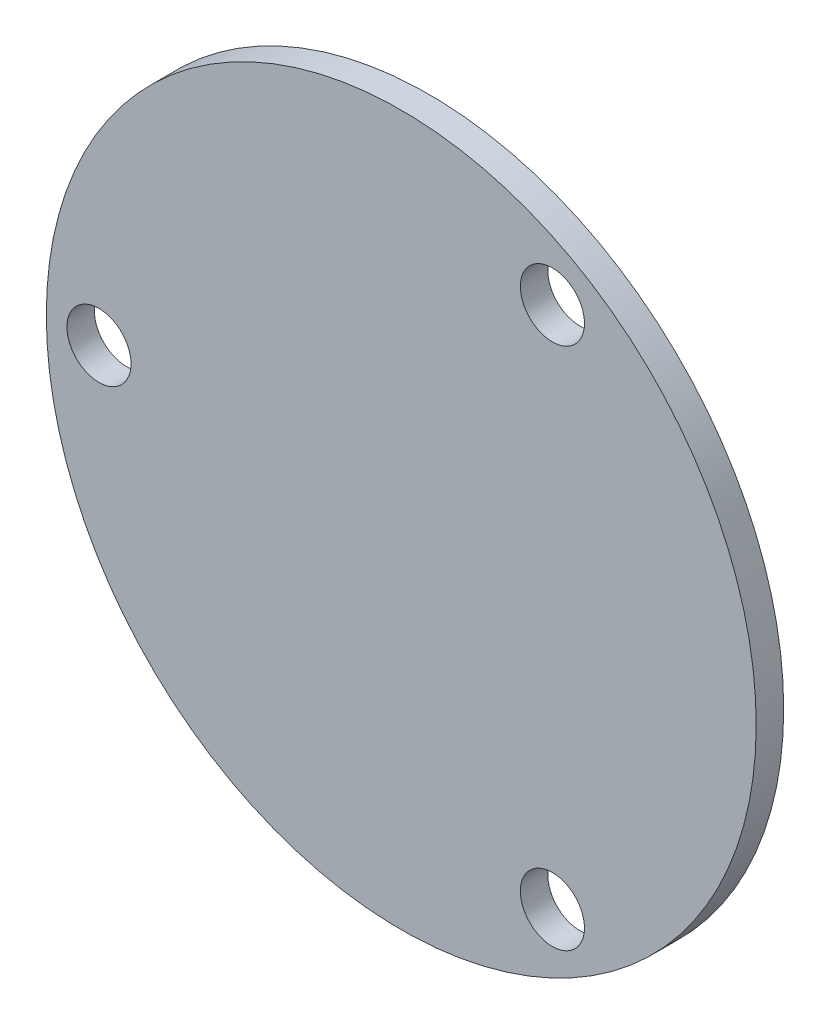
ISO-10303-21;
HEADER;
FILE_DESCRIPTION(('STEP AP214'),'2;1');
FILE_NAME('part.step','',(''),(''),'','','');
FILE_SCHEMA(('AUTOMOTIVE_DESIGN { 1 0 10303 214 1 1 1 1 }'));
ENDSEC;
DATA;
#1=APPLICATION_CONTEXT('core data for automotive mechanical design processes');
#2=APPLICATION_PROTOCOL_DEFINITION('international standard','automotive_design',2000,#1);
#3=PRODUCT_CONTEXT('',#1,'mechanical');
#4=PRODUCT('Part','Part','',(#3));
#5=PRODUCT_RELATED_PRODUCT_CATEGORY('part','',(#4));
#6=PRODUCT_DEFINITION_FORMATION('','',#4);
#7=PRODUCT_DEFINITION_CONTEXT('part definition',#1,'design');
#8=PRODUCT_DEFINITION('design','',#6,#7);
#9=PRODUCT_DEFINITION_SHAPE('','',#8);
#10=(LENGTH_UNIT() NAMED_UNIT(*) SI_UNIT(.MILLI.,.METRE.));
#11=(NAMED_UNIT(*) PLANE_ANGLE_UNIT() SI_UNIT($,.RADIAN.));
#12=(NAMED_UNIT(*) SI_UNIT($,.STERADIAN.) SOLID_ANGLE_UNIT());
#13=UNCERTAINTY_MEASURE_WITH_UNIT(LENGTH_MEASURE(1.E-05),#10,'distance_accuracy_value','');
#14=(GEOMETRIC_REPRESENTATION_CONTEXT(3) GLOBAL_UNCERTAINTY_ASSIGNED_CONTEXT((#13)) GLOBAL_UNIT_ASSIGNED_CONTEXT((#10,
#11,#12)) REPRESENTATION_CONTEXT('',''));
#15=CARTESIAN_POINT('',(0.,0.,0.));
#16=DIRECTION('',(0.,0.,1.));
#17=DIRECTION('',(1.,0.,0.));
#18=AXIS2_PLACEMENT_3D('',#15,#16,#17);
#19=CARTESIAN_POINT('',(0.,0.,3.));
#20=DIRECTION('',(0.,0.,1.));
#21=DIRECTION('',(1.,0.,0.));
#22=AXIS2_PLACEMENT_3D('',#19,#20,#21);
#23=PLANE('',#22);
#24=CARTESIAN_POINT('',(16.5000000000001,28.5788383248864,3.));
#25=DIRECTION('',(0.,0.,1.));
#26=DIRECTION('',(1.,0.,0.));
#27=AXIS2_PLACEMENT_3D('',#24,#25,#26);
#28=CIRCLE('',#27,3.5);
#29=CARTESIAN_POINT('',(20.0000000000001,28.5788383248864,3.));
#30=VERTEX_POINT('',#29);
#31=EDGE_CURVE('E46',#30,#30,#28,.T.);
#32=ORIENTED_EDGE('',*,*,#31,.F.);
#33=EDGE_LOOP('',(#32));
#34=FACE_BOUND('',#33,.T.);
#35=CARTESIAN_POINT('',(0.,0.,3.));
#36=DIRECTION('',(0.,0.,1.));
#37=DIRECTION('',(1.,0.,0.));
#38=AXIS2_PLACEMENT_3D('',#35,#36,#37);
#39=CIRCLE('',#38,38.75);
#40=CARTESIAN_POINT('',(38.75,0.,3.));
#41=VERTEX_POINT('',#40);
#42=EDGE_CURVE('E10',#41,#41,#39,.T.);
#43=ORIENTED_EDGE('',*,*,#42,.T.);
#44=EDGE_LOOP('',(#43));
#45=FACE_BOUND('',#44,.T.);
#46=CARTESIAN_POINT('',(-33.,0.,3.));
#47=DIRECTION('',(0.,0.,1.));
#48=DIRECTION('',(1.,0.,0.));
#49=AXIS2_PLACEMENT_3D('',#46,#47,#48);
#50=CIRCLE('',#49,3.5);
#51=CARTESIAN_POINT('',(-29.5,0.,3.));
#52=VERTEX_POINT('',#51);
#53=EDGE_CURVE('E41',#52,#52,#50,.T.);
#54=ORIENTED_EDGE('',*,*,#53,.F.);
#55=EDGE_LOOP('',(#54));
#56=FACE_BOUND('',#55,.T.);
#57=CARTESIAN_POINT('',(16.4999999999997,-28.5788383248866,3.));
#58=DIRECTION('',(0.,0.,1.));
#59=DIRECTION('',(1.,0.,0.));
#60=AXIS2_PLACEMENT_3D('',#57,#58,#59);
#61=CIRCLE('',#60,3.5);
#62=CARTESIAN_POINT('',(19.9999999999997,-28.5788383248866,3.));
#63=VERTEX_POINT('',#62);
#64=EDGE_CURVE('E52',#63,#63,#61,.T.);
#65=ORIENTED_EDGE('',*,*,#64,.F.);
#66=EDGE_LOOP('',(#65));
#67=FACE_BOUND('',#66,.T.);
#68=ADVANCED_FACE('F30',(#34,#45,#56,#67),#23,.T.);
#69=CARTESIAN_POINT('',(0.,0.,0.));
#70=DIRECTION('',(0.,0.,1.));
#71=DIRECTION('',(1.,0.,0.));
#72=AXIS2_PLACEMENT_3D('',#69,#70,#71);
#73=PLANE('',#72);
#74=CARTESIAN_POINT('',(16.5000000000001,28.5788383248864,0.));
#75=DIRECTION('',(0.,0.,1.));
#76=DIRECTION('',(1.,0.,0.));
#77=AXIS2_PLACEMENT_3D('',#74,#75,#76);
#78=CIRCLE('',#77,3.5);
#79=CARTESIAN_POINT('',(20.0000000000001,28.5788383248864,0.));
#80=VERTEX_POINT('',#79);
#81=EDGE_CURVE('E49',#80,#80,#78,.T.);
#82=ORIENTED_EDGE('',*,*,#81,.T.);
#83=EDGE_LOOP('',(#82));
#84=FACE_BOUND('',#83,.T.);
#85=CARTESIAN_POINT('',(0.,0.,0.));
#86=DIRECTION('',(0.,0.,1.));
#87=DIRECTION('',(1.,0.,0.));
#88=AXIS2_PLACEMENT_3D('',#85,#86,#87);
#89=CIRCLE('',#88,38.75);
#90=CARTESIAN_POINT('',(38.75,0.,0.));
#91=VERTEX_POINT('',#90);
#92=EDGE_CURVE('E34',#91,#91,#89,.T.);
#93=ORIENTED_EDGE('',*,*,#92,.F.);
#94=EDGE_LOOP('',(#93));
#95=FACE_BOUND('',#94,.T.);
#96=CARTESIAN_POINT('',(-33.,0.,0.));
#97=DIRECTION('',(0.,0.,1.));
#98=DIRECTION('',(1.,0.,0.));
#99=AXIS2_PLACEMENT_3D('',#96,#97,#98);
#100=CIRCLE('',#99,3.5);
#101=CARTESIAN_POINT('',(-29.5,0.,0.));
#102=VERTEX_POINT('',#101);
#103=EDGE_CURVE('E43',#102,#102,#100,.T.);
#104=ORIENTED_EDGE('',*,*,#103,.T.);
#105=EDGE_LOOP('',(#104));
#106=FACE_BOUND('',#105,.T.);
#107=CARTESIAN_POINT('',(16.4999999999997,-28.5788383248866,0.));
#108=DIRECTION('',(0.,0.,1.));
#109=DIRECTION('',(1.,0.,0.));
#110=AXIS2_PLACEMENT_3D('',#107,#108,#109);
#111=CIRCLE('',#110,3.5);
#112=CARTESIAN_POINT('',(19.9999999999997,-28.5788383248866,0.));
#113=VERTEX_POINT('',#112);
#114=EDGE_CURVE('E55',#113,#113,#111,.T.);
#115=ORIENTED_EDGE('',*,*,#114,.T.);
#116=EDGE_LOOP('',(#115));
#117=FACE_BOUND('',#116,.T.);
#118=ADVANCED_FACE('F65',(#84,#95,#106,#117),#73,.F.);
#119=CARTESIAN_POINT('',(0.,0.,3.));
#120=DIRECTION('',(0.,0.,-1.));
#121=DIRECTION('',(-1.,0.,0.));
#122=AXIS2_PLACEMENT_3D('',#119,#120,#121);
#123=CYLINDRICAL_SURFACE('',#122,38.75);
#124=ORIENTED_EDGE('',*,*,#42,.F.);
#125=EDGE_LOOP('',(#124));
#126=FACE_BOUND('',#125,.T.);
#127=ORIENTED_EDGE('',*,*,#92,.T.);
#128=EDGE_LOOP('',(#127));
#129=FACE_BOUND('',#128,.T.);
#130=ADVANCED_FACE('F32',(#126,#129),#123,.T.);
#131=CARTESIAN_POINT('',(-33.,0.,3.));
#132=DIRECTION('',(0.,0.,-1.));
#133=DIRECTION('',(-1.,0.,0.));
#134=AXIS2_PLACEMENT_3D('',#131,#132,#133);
#135=CYLINDRICAL_SURFACE('',#134,3.5);
#136=ORIENTED_EDGE('',*,*,#53,.T.);
#137=EDGE_LOOP('',(#136));
#138=FACE_BOUND('',#137,.T.);
#139=ORIENTED_EDGE('',*,*,#103,.F.);
#140=EDGE_LOOP('',(#139));
#141=FACE_BOUND('',#140,.T.);
#142=ADVANCED_FACE('F74',(#138,#141),#135,.F.);
#143=CARTESIAN_POINT('',(16.5000000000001,28.5788383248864,3.));
#144=DIRECTION('',(0.,0.,-1.));
#145=DIRECTION('',(-1.,0.,0.));
#146=AXIS2_PLACEMENT_3D('',#143,#144,#145);
#147=CYLINDRICAL_SURFACE('',#146,3.5);
#148=ORIENTED_EDGE('',*,*,#31,.T.);
#149=EDGE_LOOP('',(#148));
#150=FACE_BOUND('',#149,.T.);
#151=ORIENTED_EDGE('',*,*,#81,.F.);
#152=EDGE_LOOP('',(#151));
#153=FACE_BOUND('',#152,.T.);
#154=ADVANCED_FACE('F77',(#150,#153),#147,.F.);
#155=CARTESIAN_POINT('',(16.4999999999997,-28.5788383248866,3.));
#156=DIRECTION('',(0.,0.,-1.));
#157=DIRECTION('',(-1.,0.,0.));
#158=AXIS2_PLACEMENT_3D('',#155,#156,#157);
#159=CYLINDRICAL_SURFACE('',#158,3.5);
#160=ORIENTED_EDGE('',*,*,#64,.T.);
#161=EDGE_LOOP('',(#160));
#162=FACE_BOUND('',#161,.T.);
#163=ORIENTED_EDGE('',*,*,#114,.F.);
#164=EDGE_LOOP('',(#163));
#165=FACE_BOUND('',#164,.T.);
#166=ADVANCED_FACE('F61',(#162,#165),#159,.F.);
#167=CLOSED_SHELL('',(#68,#118,#130,#142,#154,#166));
#168=MANIFOLD_SOLID_BREP('B2',#167);
#169=ADVANCED_BREP_SHAPE_REPRESENTATION('',(#18,#168),#14);
#170=SHAPE_DEFINITION_REPRESENTATION(#9,#169);
ENDSEC;
END-ISO-10303-21;
